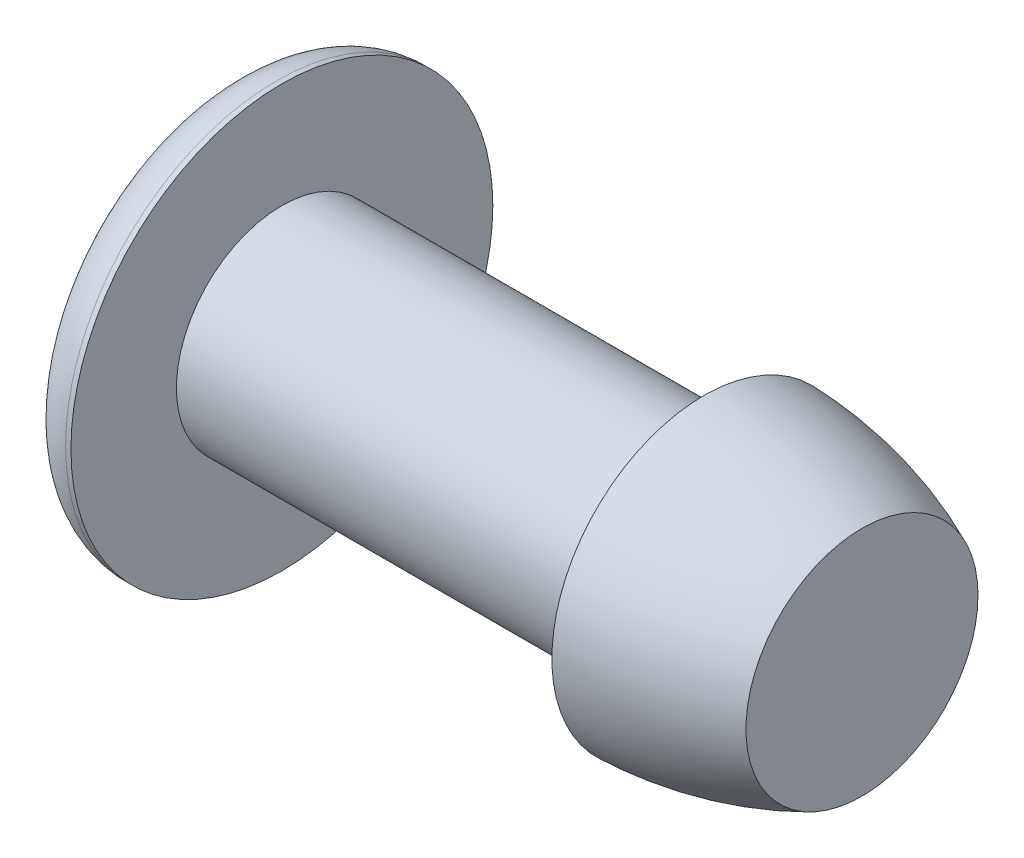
ISO-10303-21;
HEADER;
FILE_DESCRIPTION(('STEP AP214'),'2;1');
FILE_NAME('part.step','',(''),(''),'','','');
FILE_SCHEMA(('AUTOMOTIVE_DESIGN { 1 0 10303 214 1 1 1 1 }'));
ENDSEC;
DATA;
#1=APPLICATION_CONTEXT('core data for automotive mechanical design processes');
#2=APPLICATION_PROTOCOL_DEFINITION('international standard','automotive_design',2000,#1);
#3=PRODUCT_CONTEXT('',#1,'mechanical');
#4=PRODUCT('Part','Part','',(#3));
#5=PRODUCT_RELATED_PRODUCT_CATEGORY('part','',(#4));
#6=PRODUCT_DEFINITION_FORMATION('','',#4);
#7=PRODUCT_DEFINITION_CONTEXT('part definition',#1,'design');
#8=PRODUCT_DEFINITION('design','',#6,#7);
#9=PRODUCT_DEFINITION_SHAPE('','',#8);
#10=(LENGTH_UNIT() NAMED_UNIT(*) SI_UNIT(.MILLI.,.METRE.));
#11=(NAMED_UNIT(*) PLANE_ANGLE_UNIT() SI_UNIT($,.RADIAN.));
#12=(NAMED_UNIT(*) SI_UNIT($,.STERADIAN.) SOLID_ANGLE_UNIT());
#13=UNCERTAINTY_MEASURE_WITH_UNIT(LENGTH_MEASURE(1.E-05),#10,'distance_accuracy_value','');
#14=(GEOMETRIC_REPRESENTATION_CONTEXT(3) GLOBAL_UNCERTAINTY_ASSIGNED_CONTEXT((#13)) GLOBAL_UNIT_ASSIGNED_CONTEXT((#10,
#11,#12)) REPRESENTATION_CONTEXT('',''));
#15=CARTESIAN_POINT('',(0.,0.,0.));
#16=DIRECTION('',(0.,0.,1.));
#17=DIRECTION('',(1.,0.,0.));
#18=AXIS2_PLACEMENT_3D('',#15,#16,#17);
#19=CARTESIAN_POINT('',(-0.999999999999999,2.,0.));
#20=DIRECTION('',(-1.,0.,0.));
#21=DIRECTION('',(0.,-1.,0.));
#22=AXIS2_PLACEMENT_3D('',#19,#20,#21);
#23=PLANE('',#22);
#24=CARTESIAN_POINT('',(-0.999999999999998,0.,0.));
#25=DIRECTION('',(1.,0.,0.));
#26=DIRECTION('',(0.,1.,0.));
#27=AXIS2_PLACEMENT_3D('',#24,#25,#26);
#28=CIRCLE('',#27,3.1);
#29=CARTESIAN_POINT('',(-0.999999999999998,3.1,0.));
#30=VERTEX_POINT('',#29);
#31=EDGE_CURVE('E47',#30,#30,#28,.T.);
#32=ORIENTED_EDGE('',*,*,#31,.F.);
#33=EDGE_LOOP('',(#32));
#34=FACE_BOUND('',#33,.T.);
#35=ADVANCED_FACE('F15',(#34),#23,.T.);
#36=CARTESIAN_POINT('',(11.0001,1.1,0.));
#37=DIRECTION('',(1.,0.,0.));
#38=DIRECTION('',(0.,1.,0.));
#39=AXIS2_PLACEMENT_3D('',#36,#37,#38);
#40=PLANE('',#39);
#41=CARTESIAN_POINT('',(11.0001,0.,0.));
#42=DIRECTION('',(1.,0.,0.));
#43=DIRECTION('',(0.,0.,-1.));
#44=AXIS2_PLACEMENT_3D('',#41,#42,#43);
#45=CIRCLE('',#44,2.2);
#46=CARTESIAN_POINT('',(11.0001,0.,-2.2));
#47=VERTEX_POINT('',#46);
#48=EDGE_CURVE('E19',#47,#47,#45,.T.);
#49=ORIENTED_EDGE('',*,*,#48,.T.);
#50=EDGE_LOOP('',(#49));
#51=FACE_BOUND('',#50,.T.);
#52=ADVANCED_FACE('F60',(#51),#40,.T.);
#53=CARTESIAN_POINT('',(-0.0999999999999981,0.,0.));
#54=DIRECTION('',(1.,0.,0.));
#55=DIRECTION('',(0.,0.,-1.));
#56=AXIS2_PLACEMENT_3D('',#53,#54,#55);
#57=TOROIDAL_SURFACE('',#56,3.1,0.9);
#58=CARTESIAN_POINT('',(-0.0999999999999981,0.,0.));
#59=DIRECTION('',(1.,0.,0.));
#60=DIRECTION('',(0.,1.,0.));
#61=AXIS2_PLACEMENT_3D('',#58,#59,#60);
#62=CIRCLE('',#61,4.);
#63=CARTESIAN_POINT('',(-0.0999999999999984,4.,0.));
#64=VERTEX_POINT('',#63);
#65=EDGE_CURVE('E39',#64,#64,#62,.T.);
#66=ORIENTED_EDGE('',*,*,#65,.F.);
#67=EDGE_LOOP('',(#66));
#68=FACE_BOUND('',#67,.T.);
#69=ORIENTED_EDGE('',*,*,#31,.T.);
#70=EDGE_LOOP('',(#69));
#71=FACE_BOUND('',#70,.T.);
#72=ADVANCED_FACE('F55',(#68,#71),#57,.T.);
#73=CARTESIAN_POINT('',(7.76461906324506,0.,0.));
#74=DIRECTION('',(1.,0.,0.));
#75=DIRECTION('',(0.,0.,-1.));
#76=AXIS2_PLACEMENT_3D('',#73,#74,#75);
#77=DEGENERATE_TOROIDAL_SURFACE('',#76,5.11653354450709,8.00000000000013,.F.);
#78=CARTESIAN_POINT('',(8.0001,0.,0.));
#79=DIRECTION('',(1.,0.,0.));
#80=DIRECTION('',(0.,0.,-1.));
#81=AXIS2_PLACEMENT_3D('',#78,#79,#80);
#82=CIRCLE('',#81,2.88);
#83=CARTESIAN_POINT('',(8.0001,0.,-2.88));
#84=VERTEX_POINT('',#83);
#85=EDGE_CURVE('E37',#84,#84,#82,.F.);
#86=ORIENTED_EDGE('',*,*,#85,.F.);
#87=EDGE_LOOP('',(#86));
#88=FACE_BOUND('',#87,.T.);
#89=ORIENTED_EDGE('',*,*,#48,.F.);
#90=EDGE_LOOP('',(#89));
#91=FACE_BOUND('',#90,.T.);
#92=ADVANCED_FACE('F17',(#88,#91),#77,.F.);
#93=CARTESIAN_POINT('',(-0.499999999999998,0.,0.));
#94=DIRECTION('',(1.,0.,0.));
#95=DIRECTION('',(0.,1.,0.));
#96=AXIS2_PLACEMENT_3D('',#93,#94,#95);
#97=CYLINDRICAL_SURFACE('',#96,4.);
#98=ORIENTED_EDGE('',*,*,#65,.T.);
#99=EDGE_LOOP('',(#98));
#100=FACE_BOUND('',#99,.T.);
#101=CARTESIAN_POINT('',(0.,0.,0.));
#102=DIRECTION('',(1.,0.,0.));
#103=DIRECTION('',(0.,1.,0.));
#104=AXIS2_PLACEMENT_3D('',#101,#102,#103);
#105=CIRCLE('',#104,4.);
#106=CARTESIAN_POINT('',(0.,4.,0.));
#107=VERTEX_POINT('',#106);
#108=EDGE_CURVE('E28',#107,#107,#105,.T.);
#109=ORIENTED_EDGE('',*,*,#108,.F.);
#110=EDGE_LOOP('',(#109));
#111=FACE_BOUND('',#110,.T.);
#112=ADVANCED_FACE('F62',(#100,#111),#97,.T.);
#113=CARTESIAN_POINT('',(8.0001,2.44,0.));
#114=DIRECTION('',(-1.,0.,0.));
#115=DIRECTION('',(0.,-1.,0.));
#116=AXIS2_PLACEMENT_3D('',#113,#114,#115);
#117=PLANE('',#116);
#118=CARTESIAN_POINT('',(8.0001,0.,0.));
#119=DIRECTION('',(1.,0.,0.));
#120=DIRECTION('',(0.,1.,0.));
#121=AXIS2_PLACEMENT_3D('',#118,#119,#120);
#122=CIRCLE('',#121,2.);
#123=CARTESIAN_POINT('',(8.0001,2.,0.));
#124=VERTEX_POINT('',#123);
#125=EDGE_CURVE('E23',#124,#124,#122,.F.);
#126=ORIENTED_EDGE('',*,*,#125,.F.);
#127=EDGE_LOOP('',(#126));
#128=FACE_BOUND('',#127,.T.);
#129=ORIENTED_EDGE('',*,*,#85,.T.);
#130=EDGE_LOOP('',(#129));
#131=FACE_BOUND('',#130,.T.);
#132=ADVANCED_FACE('F88',(#128,#131),#117,.T.);
#133=CARTESIAN_POINT('',(0.,3.,0.));
#134=DIRECTION('',(1.,0.,0.));
#135=DIRECTION('',(0.,1.,0.));
#136=AXIS2_PLACEMENT_3D('',#133,#134,#135);
#137=PLANE('',#136);
#138=CARTESIAN_POINT('',(0.,0.,0.));
#139=DIRECTION('',(1.,0.,0.));
#140=DIRECTION('',(0.,1.,0.));
#141=AXIS2_PLACEMENT_3D('',#138,#139,#140);
#142=CIRCLE('',#141,2.);
#143=CARTESIAN_POINT('',(0.,2.,0.));
#144=VERTEX_POINT('',#143);
#145=EDGE_CURVE('E10',#144,#144,#142,.T.);
#146=ORIENTED_EDGE('',*,*,#145,.F.);
#147=EDGE_LOOP('',(#146));
#148=FACE_BOUND('',#147,.T.);
#149=ORIENTED_EDGE('',*,*,#108,.T.);
#150=EDGE_LOOP('',(#149));
#151=FACE_BOUND('',#150,.T.);
#152=ADVANCED_FACE('F83',(#148,#151),#137,.T.);
#153=CARTESIAN_POINT('',(4.00005,0.,0.));
#154=DIRECTION('',(1.,0.,0.));
#155=DIRECTION('',(0.,1.,0.));
#156=AXIS2_PLACEMENT_3D('',#153,#154,#155);
#157=CYLINDRICAL_SURFACE('',#156,2.);
#158=ORIENTED_EDGE('',*,*,#145,.T.);
#159=EDGE_LOOP('',(#158));
#160=FACE_BOUND('',#159,.T.);
#161=ORIENTED_EDGE('',*,*,#125,.T.);
#162=EDGE_LOOP('',(#161));
#163=FACE_BOUND('',#162,.T.);
#164=ADVANCED_FACE('F81',(#160,#163),#157,.T.);
#165=CLOSED_SHELL('',(#35,#52,#72,#92,#112,#132,#152,#164));
#166=MANIFOLD_SOLID_BREP('B1',#165);
#167=ADVANCED_BREP_SHAPE_REPRESENTATION('',(#18,#166),#14);
#168=SHAPE_DEFINITION_REPRESENTATION(#9,#167);
ENDSEC;
END-ISO-10303-21;
